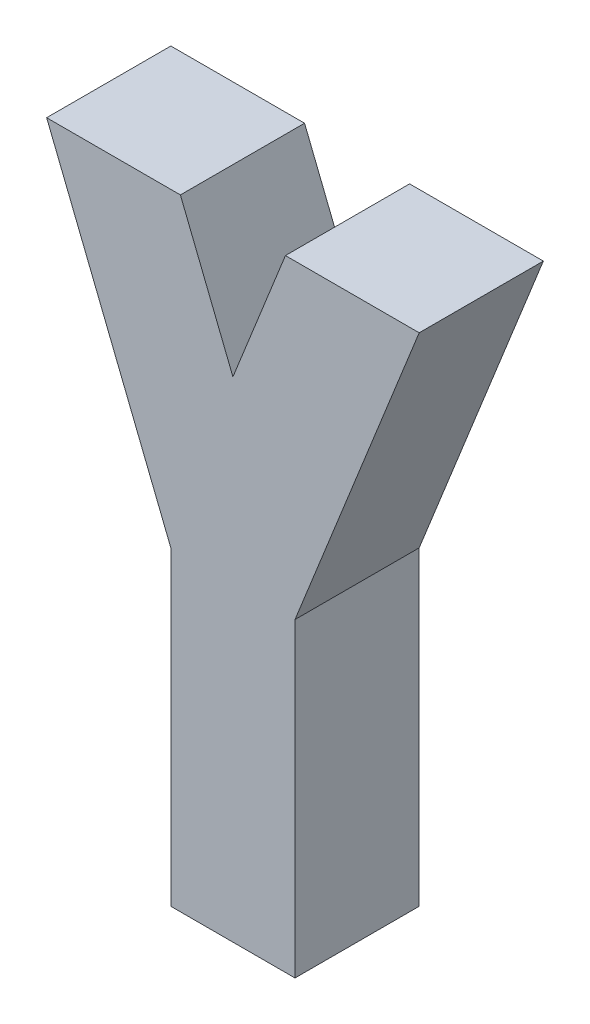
from build123d import *

# Parameters (mm, degrees)
BOSS_EXTRU_1_DEPTH = 10


with BuildPart() as part:
    # Esquisse1 → Boss.-Extru.1 (new body)
    with BuildSketch(Plane.XY):
        Polygon((10, 0), (10, 25), (0, 50), (10.770329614, 50), (15, 39.425824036), (19.229670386, 50), (30, 50), (20, 25), (20, 0), align=None)
    extrude(amount=BOSS_EXTRU_1_DEPTH)


solid = part.part
